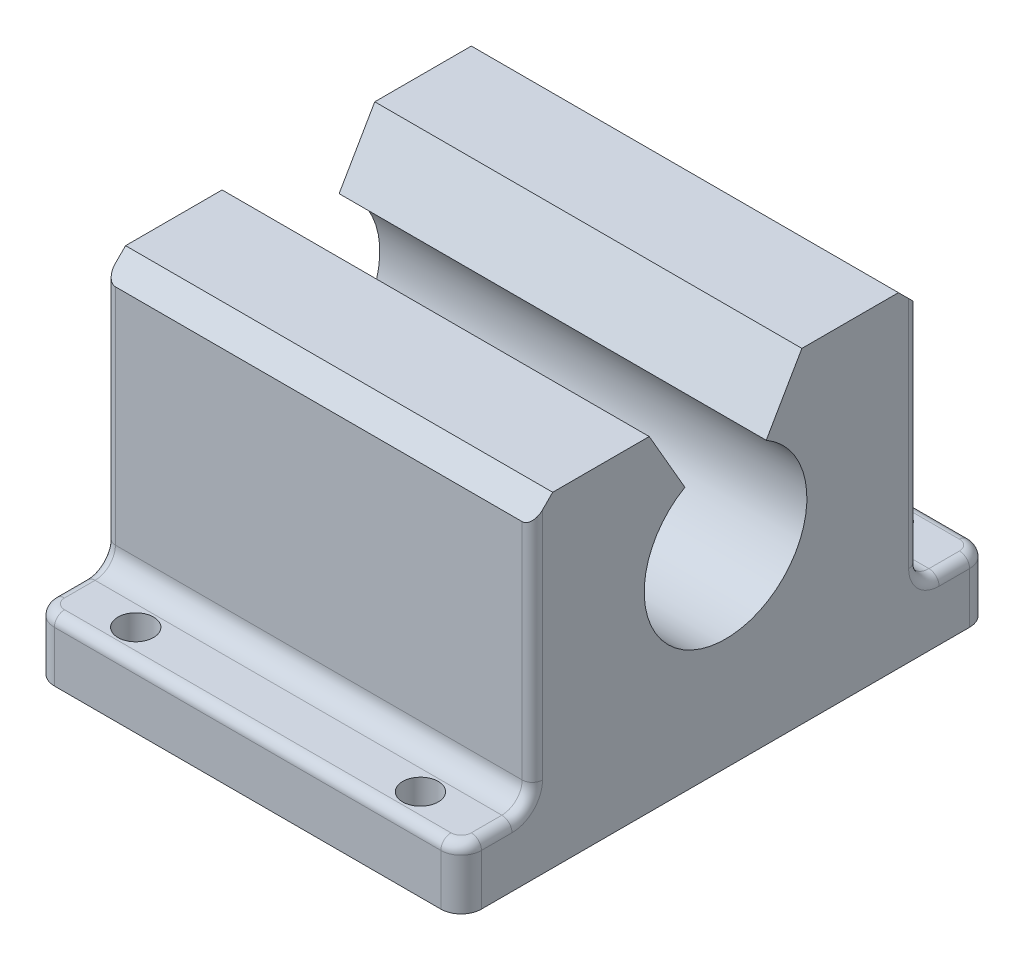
from build123d import *

# Parameters (mm, degrees)
SKETCH1_R            = 12.7
BASE_EXTRUDE_DEPTH   = 66.675
SKETCH2_R            = 2.778125
CUT_EXTRUDE1_DEPTH   = 89.61606443
LPATTERN1_COUNT      = 2
LPATTERN1_PITCH      = 44.45
LPATTERN1_COUNT_DIR2 = 2
LPATTERN1_PITCH_DIR2 = 73.025
CUT_EXTRUDE2_DEPTH   = 94.433512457
CHAMFER1_SIZE        = 3.175
FILLET1_R            = 3.175
FILLET2_R            = 1.5875


with BuildPart() as part:
    # Sketch1 → Base-Extrude (new body)
    with BuildSketch(Plane(origin=(0, 0, 0), x_dir=(0, 0, -1), z_dir=(1, 0, 0))):
        Polygon((-41.275, 0), (41.275, 0), (41.275, 9.525), (30.1625, 9.525), (30.1625, 50.8), (-30.1625, 50.8), (-30.1625, 9.525), (-41.275, 9.525), align=None)
        with Locations((0, 30.1625)):
            Circle(SKETCH1_R, mode=Mode.SUBTRACT)
    extrude(amount=BASE_EXTRUDE_DEPTH)

    # Sketch2 → Cut-Extrude1 (cut, through all)
    with BuildSketch(Plane(origin=(0, 9.525, 0), x_dir=(-1, 0, 0), z_dir=(0, 1, 0))):
        with Locations(Location((-55.5625, 36.5125, 0), (0, 0, 90))):
            Circle(SKETCH2_R)
    cut_extrude1 = extrude(amount=-CUT_EXTRUDE1_DEPTH, mode=Mode.SUBTRACT)

    # LPattern1: Cut-Extrude1 2 × 2
    with Locations(*[(-i * LPATTERN1_PITCH, 0, -j * LPATTERN1_PITCH_DIR2) for i in range(LPATTERN1_COUNT) for j in range(LPATTERN1_COUNT_DIR2) if (i, j) != (0, 0)]):
        add(cut_extrude1, mode=Mode.SUBTRACT)

    # Sketch3 → Cut-Extrude2 (cut, through all)
    with BuildSketch(Plane(origin=(66.675, 0, 0), x_dir=(0, 0, -1), z_dir=(1, 0, 0))):
        Polygon((11.91506618, 50.8), (-11.91506618, 50.8), (0, 30.1625), align=None)
    extrude(amount=-CUT_EXTRUDE2_DEPTH, mode=Mode.SUBTRACT)

    # Chamfer1
    chamfer1_edges = [part.edges().sort_by_distance(p)[0] for p in [
        (33.3375, 50.8, 30.1625),
        (33.3375, 50.8, -30.1625),
    ]]
    chamfer(chamfer1_edges, length=CHAMFER1_SIZE)

    # Fillet1
    fillet1_edges = [part.edges().sort_by_distance(p)[0] for p in [
        (33.3375, 9.525, 30.1625),
        (33.3375, 9.525, -30.1625),
        (66.675, 4.7625, 41.275),
        (66.675, 4.7625, -41.275),
        (0, 4.7625, 41.275),
        (0, 4.7625, -41.275),
    ]]
    fillet(fillet1_edges, radius=FILLET1_R)

    # Fillet2
    fillet2_edges = [part.edges().sort_by_distance(p)[0] for p in [
        (0, 30.1625, -30.1625),
        (66.675, 30.1625, -30.1625),
        (0, 9.525, -35.71875),
        (66.675, 9.525, -35.71875),
        (33.3375, 9.525, -41.275),
        (65.74506403, 9.525, -40.34506403),
        (0.92993597, 9.525, -40.34506403),
        (0, 9.525, 35.71875),
        (33.3375, 9.525, 41.275),
        (66.675, 9.525, 35.71875),
        (65.74506403, 9.525, 40.34506403),
        (0.92993597, 9.525, 40.34506403),
        (66.675, 30.1625, 30.1625),
        (0, 30.1625, 30.1625),
        (0, 10.45493597, -31.09243597),
        (66.675, 10.45493597, -31.09243597),
        (0, 10.45493597, 31.09243597),
        (66.675, 10.45493597, 31.09243597),
    ]]
    fillet(fillet2_edges, radius=FILLET2_R)


solid = part.part
